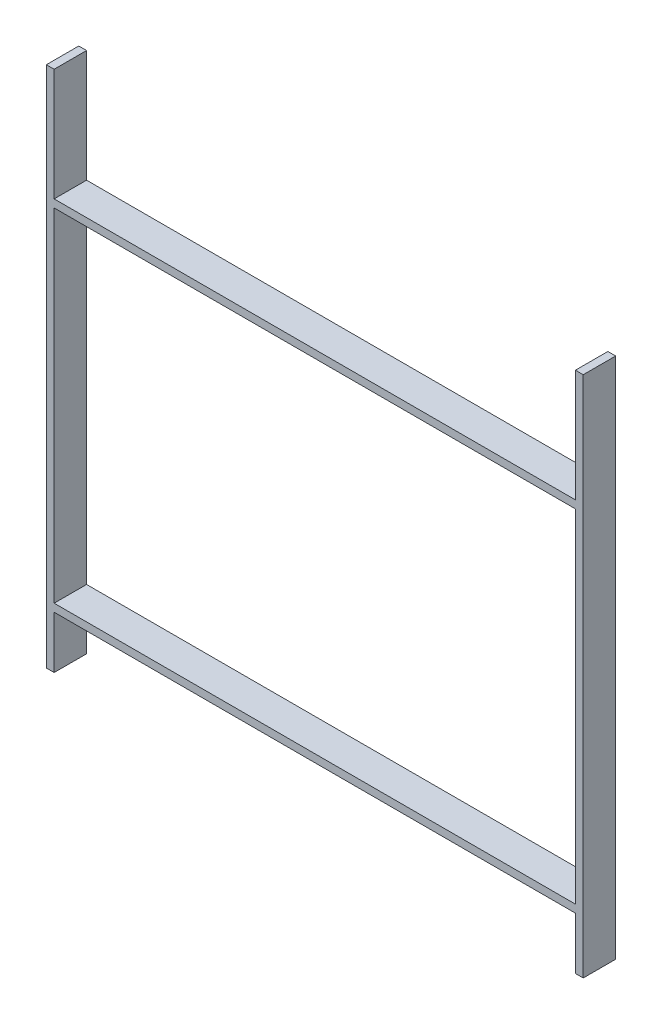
ISO-10303-21;
HEADER;
FILE_DESCRIPTION(('STEP AP214'),'2;1');
FILE_NAME('part.step','',(''),(''),'','','');
FILE_SCHEMA(('AUTOMOTIVE_DESIGN { 1 0 10303 214 1 1 1 1 }'));
ENDSEC;
DATA;
#1=APPLICATION_CONTEXT('core data for automotive mechanical design processes');
#2=APPLICATION_PROTOCOL_DEFINITION('international standard','automotive_design',2000,#1);
#3=PRODUCT_CONTEXT('',#1,'mechanical');
#4=PRODUCT('Part','Part','',(#3));
#5=PRODUCT_RELATED_PRODUCT_CATEGORY('part','',(#4));
#6=PRODUCT_DEFINITION_FORMATION('','',#4);
#7=PRODUCT_DEFINITION_CONTEXT('part definition',#1,'design');
#8=PRODUCT_DEFINITION('design','',#6,#7);
#9=PRODUCT_DEFINITION_SHAPE('','',#8);
#10=(LENGTH_UNIT() NAMED_UNIT(*) SI_UNIT(.MILLI.,.METRE.));
#11=(NAMED_UNIT(*) PLANE_ANGLE_UNIT() SI_UNIT($,.RADIAN.));
#12=(NAMED_UNIT(*) SI_UNIT($,.STERADIAN.) SOLID_ANGLE_UNIT());
#13=UNCERTAINTY_MEASURE_WITH_UNIT(LENGTH_MEASURE(1.E-05),#10,'distance_accuracy_value','');
#14=(GEOMETRIC_REPRESENTATION_CONTEXT(3) GLOBAL_UNCERTAINTY_ASSIGNED_CONTEXT((#13)) GLOBAL_UNIT_ASSIGNED_CONTEXT((#10,
#11,#12)) REPRESENTATION_CONTEXT('',''));
#15=CARTESIAN_POINT('',(0.,0.,0.));
#16=DIRECTION('',(0.,0.,1.));
#17=DIRECTION('',(1.,0.,0.));
#18=AXIS2_PLACEMENT_3D('',#15,#16,#17);
#19=CARTESIAN_POINT('',(-223.5,-149.,27.));
#20=DIRECTION('',(0.,0.,1.));
#21=DIRECTION('',(1.,0.,0.));
#22=AXIS2_PLACEMENT_3D('',#19,#20,#21);
#23=PLANE('',#22);
#24=DIRECTION('',(1.,0.,0.));
#25=VECTOR('',#24,1.);
#26=CARTESIAN_POINT('',(-217.,-142.5,27.));
#27=LINE('',#26,#25);
#28=CARTESIAN_POINT('',(-217.,-142.5,27.));
#29=VERTEX_POINT('',#28);
#30=CARTESIAN_POINT('',(217.,-142.5,27.));
#31=VERTEX_POINT('',#30);
#32=EDGE_CURVE('E230',#29,#31,#27,.T.);
#33=ORIENTED_EDGE('',*,*,#32,.F.);
#34=DIRECTION('',(0.,-1.,0.));
#35=VECTOR('',#34,1.);
#36=CARTESIAN_POINT('',(-217.,142.5,27.));
#37=LINE('',#36,#35);
#38=CARTESIAN_POINT('',(-217.,142.5,27.));
#39=VERTEX_POINT('',#38);
#40=EDGE_CURVE('E228',#39,#29,#37,.T.);
#41=ORIENTED_EDGE('',*,*,#40,.F.);
#42=DIRECTION('',(-1.,0.,0.));
#43=VECTOR('',#42,1.);
#44=CARTESIAN_POINT('',(-217.,142.5,27.));
#45=LINE('',#44,#43);
#46=CARTESIAN_POINT('',(217.,142.5,27.));
#47=VERTEX_POINT('',#46);
#48=EDGE_CURVE('E236',#47,#39,#45,.T.);
#49=ORIENTED_EDGE('',*,*,#48,.F.);
#50=DIRECTION('',(0.,1.,0.));
#51=VECTOR('',#50,1.);
#52=CARTESIAN_POINT('',(217.,142.5,27.));
#53=LINE('',#52,#51);
#54=EDGE_CURVE('E233',#31,#47,#53,.T.);
#55=ORIENTED_EDGE('',*,*,#54,.F.);
#56=EDGE_LOOP('',(#33,#41,#49,#55));
#57=FACE_BOUND('',#56,.T.);
#58=DIRECTION('',(0.,1.,0.));
#59=VECTOR('',#58,1.);
#60=CARTESIAN_POINT('',(-217.,-142.5,27.));
#61=LINE('',#60,#59);
#62=CARTESIAN_POINT('',(-217.,-192.5,27.));
#63=VERTEX_POINT('',#62);
#64=CARTESIAN_POINT('',(-217.,-149.,27.));
#65=VERTEX_POINT('',#64);
#66=EDGE_CURVE('E164',#63,#65,#61,.T.);
#67=ORIENTED_EDGE('',*,*,#66,.T.);
#68=DIRECTION('',(1.,0.,0.));
#69=VECTOR('',#68,1.);
#70=CARTESIAN_POINT('',(-223.5,-149.,27.));
#71=LINE('',#70,#69);
#72=CARTESIAN_POINT('',(217.,-149.,27.));
#73=VERTEX_POINT('',#72);
#74=EDGE_CURVE('E48',#65,#73,#71,.T.);
#75=ORIENTED_EDGE('',*,*,#74,.T.);
#76=DIRECTION('',(0.,-1.,0.));
#77=VECTOR('',#76,1.);
#78=CARTESIAN_POINT('',(217.,-142.5,27.));
#79=LINE('',#78,#77);
#80=CARTESIAN_POINT('',(217.,-192.5,27.));
#81=VERTEX_POINT('',#80);
#82=EDGE_CURVE('E173',#73,#81,#79,.T.);
#83=ORIENTED_EDGE('',*,*,#82,.T.);
#84=DIRECTION('',(1.,0.,0.));
#85=VECTOR('',#84,1.);
#86=CARTESIAN_POINT('',(217.,-192.5,27.));
#87=LINE('',#86,#85);
#88=CARTESIAN_POINT('',(223.5,-192.5,27.));
#89=VERTEX_POINT('',#88);
#90=EDGE_CURVE('E181',#81,#89,#87,.T.);
#91=ORIENTED_EDGE('',*,*,#90,.T.);
#92=DIRECTION('',(0.,1.,0.));
#93=VECTOR('',#92,1.);
#94=CARTESIAN_POINT('',(223.5,149.,27.));
#95=LINE('',#94,#93);
#96=CARTESIAN_POINT('',(223.5,242.5,27.));
#97=VERTEX_POINT('',#96);
#98=EDGE_CURVE('E40',#89,#97,#95,.T.);
#99=ORIENTED_EDGE('',*,*,#98,.T.);
#100=DIRECTION('',(-1.,0.,0.));
#101=VECTOR('',#100,1.);
#102=CARTESIAN_POINT('',(217.,242.5,27.));
#103=LINE('',#102,#101);
#104=CARTESIAN_POINT('',(217.,242.5,27.));
#105=VERTEX_POINT('',#104);
#106=EDGE_CURVE('E202',#97,#105,#103,.T.);
#107=ORIENTED_EDGE('',*,*,#106,.T.);
#108=DIRECTION('',(0.,-1.,0.));
#109=VECTOR('',#108,1.);
#110=CARTESIAN_POINT('',(217.,142.5,27.));
#111=LINE('',#110,#109);
#112=CARTESIAN_POINT('',(217.,149.,27.));
#113=VERTEX_POINT('',#112);
#114=EDGE_CURVE('E192',#105,#113,#111,.T.);
#115=ORIENTED_EDGE('',*,*,#114,.T.);
#116=DIRECTION('',(-1.,0.,0.));
#117=VECTOR('',#116,1.);
#118=CARTESIAN_POINT('',(-223.5,149.,27.));
#119=LINE('',#118,#117);
#120=CARTESIAN_POINT('',(-217.,149.,27.));
#121=VERTEX_POINT('',#120);
#122=EDGE_CURVE('E11',#113,#121,#119,.T.);
#123=ORIENTED_EDGE('',*,*,#122,.T.);
#124=DIRECTION('',(0.,1.,0.));
#125=VECTOR('',#124,1.);
#126=CARTESIAN_POINT('',(-217.,142.5,27.));
#127=LINE('',#126,#125);
#128=CARTESIAN_POINT('',(-217.,242.5,27.));
#129=VERTEX_POINT('',#128);
#130=EDGE_CURVE('E211',#121,#129,#127,.T.);
#131=ORIENTED_EDGE('',*,*,#130,.T.);
#132=DIRECTION('',(-1.,0.,0.));
#133=VECTOR('',#132,1.);
#134=CARTESIAN_POINT('',(-217.,242.5,27.));
#135=LINE('',#134,#133);
#136=CARTESIAN_POINT('',(-223.5,242.5,27.));
#137=VERTEX_POINT('',#136);
#138=EDGE_CURVE('E148',#129,#137,#135,.T.);
#139=ORIENTED_EDGE('',*,*,#138,.T.);
#140=DIRECTION('',(0.,-1.,0.));
#141=VECTOR('',#140,1.);
#142=CARTESIAN_POINT('',(-223.5,149.,27.));
#143=LINE('',#142,#141);
#144=CARTESIAN_POINT('',(-223.5,-192.5,27.));
#145=VERTEX_POINT('',#144);
#146=EDGE_CURVE('E143',#137,#145,#143,.T.);
#147=ORIENTED_EDGE('',*,*,#146,.T.);
#148=DIRECTION('',(1.,0.,0.));
#149=VECTOR('',#148,1.);
#150=CARTESIAN_POINT('',(-217.,-192.5,27.));
#151=LINE('',#150,#149);
#152=EDGE_CURVE('E146',#145,#63,#151,.T.);
#153=ORIENTED_EDGE('',*,*,#152,.T.);
#154=EDGE_LOOP('',(#67,#75,#83,#91,#99,#107,#115,#123,#131,#139,#147,#153));
#155=FACE_BOUND('',#154,.T.);
#156=ADVANCED_FACE('F31',(#57,#155),#23,.T.);
#157=CARTESIAN_POINT('',(-223.5,-149.,0.));
#158=DIRECTION('',(0.,0.,1.));
#159=DIRECTION('',(1.,0.,0.));
#160=AXIS2_PLACEMENT_3D('',#157,#158,#159);
#161=PLANE('',#160);
#162=DIRECTION('',(0.,-1.,0.));
#163=VECTOR('',#162,1.);
#164=CARTESIAN_POINT('',(-217.,142.5,0.));
#165=LINE('',#164,#163);
#166=CARTESIAN_POINT('',(-217.,142.5,0.));
#167=VERTEX_POINT('',#166);
#168=CARTESIAN_POINT('',(-217.,-142.5,0.));
#169=VERTEX_POINT('',#168);
#170=EDGE_CURVE('E227',#167,#169,#165,.T.);
#171=ORIENTED_EDGE('',*,*,#170,.T.);
#172=DIRECTION('',(1.,0.,0.));
#173=VECTOR('',#172,1.);
#174=CARTESIAN_POINT('',(-217.,-142.5,0.));
#175=LINE('',#174,#173);
#176=CARTESIAN_POINT('',(217.,-142.5,0.));
#177=VERTEX_POINT('',#176);
#178=EDGE_CURVE('E241',#169,#177,#175,.T.);
#179=ORIENTED_EDGE('',*,*,#178,.T.);
#180=DIRECTION('',(0.,1.,0.));
#181=VECTOR('',#180,1.);
#182=CARTESIAN_POINT('',(217.,142.5,0.));
#183=LINE('',#182,#181);
#184=CARTESIAN_POINT('',(217.,142.5,0.));
#185=VERTEX_POINT('',#184);
#186=EDGE_CURVE('E244',#177,#185,#183,.T.);
#187=ORIENTED_EDGE('',*,*,#186,.T.);
#188=DIRECTION('',(-1.,0.,0.));
#189=VECTOR('',#188,1.);
#190=CARTESIAN_POINT('',(-217.,142.5,0.));
#191=LINE('',#190,#189);
#192=EDGE_CURVE('E231',#185,#167,#191,.T.);
#193=ORIENTED_EDGE('',*,*,#192,.T.);
#194=EDGE_LOOP('',(#171,#179,#187,#193));
#195=FACE_BOUND('',#194,.T.);
#196=DIRECTION('',(1.,0.,0.));
#197=VECTOR('',#196,1.);
#198=CARTESIAN_POINT('',(-223.5,-149.,0.));
#199=LINE('',#198,#197);
#200=CARTESIAN_POINT('',(-217.,-149.,0.));
#201=VERTEX_POINT('',#200);
#202=CARTESIAN_POINT('',(217.,-149.,0.));
#203=VERTEX_POINT('',#202);
#204=EDGE_CURVE('E261',#201,#203,#199,.T.);
#205=ORIENTED_EDGE('',*,*,#204,.F.);
#206=DIRECTION('',(0.,-1.,0.));
#207=VECTOR('',#206,1.);
#208=CARTESIAN_POINT('',(-217.,-142.5,0.));
#209=LINE('',#208,#207);
#210=CARTESIAN_POINT('',(-217.,-192.5,0.));
#211=VERTEX_POINT('',#210);
#212=EDGE_CURVE('E174',#201,#211,#209,.T.);
#213=ORIENTED_EDGE('',*,*,#212,.T.);
#214=DIRECTION('',(-1.,0.,0.));
#215=VECTOR('',#214,1.);
#216=CARTESIAN_POINT('',(-217.,-192.5,0.));
#217=LINE('',#216,#215);
#218=CARTESIAN_POINT('',(-223.5,-192.5,0.));
#219=VERTEX_POINT('',#218);
#220=EDGE_CURVE('E169',#211,#219,#217,.T.);
#221=ORIENTED_EDGE('',*,*,#220,.T.);
#222=DIRECTION('',(0.,-1.,0.));
#223=VECTOR('',#222,1.);
#224=CARTESIAN_POINT('',(-223.5,149.,0.));
#225=LINE('',#224,#223);
#226=CARTESIAN_POINT('',(-223.5,242.5,0.));
#227=VERTEX_POINT('',#226);
#228=EDGE_CURVE('E155',#227,#219,#225,.T.);
#229=ORIENTED_EDGE('',*,*,#228,.F.);
#230=DIRECTION('',(1.,0.,0.));
#231=VECTOR('',#230,1.);
#232=CARTESIAN_POINT('',(-217.,242.5,0.));
#233=LINE('',#232,#231);
#234=CARTESIAN_POINT('',(-217.,242.5,0.));
#235=VERTEX_POINT('',#234);
#236=EDGE_CURVE('E215',#227,#235,#233,.T.);
#237=ORIENTED_EDGE('',*,*,#236,.T.);
#238=DIRECTION('',(0.,-1.,0.));
#239=VECTOR('',#238,1.);
#240=CARTESIAN_POINT('',(-217.,142.5,0.));
#241=LINE('',#240,#239);
#242=CARTESIAN_POINT('',(-217.,149.,0.));
#243=VERTEX_POINT('',#242);
#244=EDGE_CURVE('E212',#235,#243,#241,.T.);
#245=ORIENTED_EDGE('',*,*,#244,.T.);
#246=DIRECTION('',(-1.,0.,0.));
#247=VECTOR('',#246,1.);
#248=CARTESIAN_POINT('',(-223.5,149.,0.));
#249=LINE('',#248,#247);
#250=CARTESIAN_POINT('',(217.,149.,0.));
#251=VERTEX_POINT('',#250);
#252=EDGE_CURVE('E35',#251,#243,#249,.T.);
#253=ORIENTED_EDGE('',*,*,#252,.F.);
#254=DIRECTION('',(0.,1.,0.));
#255=VECTOR('',#254,1.);
#256=CARTESIAN_POINT('',(217.,142.5,0.));
#257=LINE('',#256,#255);
#258=CARTESIAN_POINT('',(217.,242.5,0.));
#259=VERTEX_POINT('',#258);
#260=EDGE_CURVE('E196',#251,#259,#257,.T.);
#261=ORIENTED_EDGE('',*,*,#260,.T.);
#262=DIRECTION('',(1.,0.,0.));
#263=VECTOR('',#262,1.);
#264=CARTESIAN_POINT('',(217.,242.5,0.));
#265=LINE('',#264,#263);
#266=CARTESIAN_POINT('',(223.5,242.5,0.));
#267=VERTEX_POINT('',#266);
#268=EDGE_CURVE('E193',#259,#267,#265,.T.);
#269=ORIENTED_EDGE('',*,*,#268,.T.);
#270=DIRECTION('',(0.,1.,0.));
#271=VECTOR('',#270,1.);
#272=CARTESIAN_POINT('',(223.5,149.,0.));
#273=LINE('',#272,#271);
#274=CARTESIAN_POINT('',(223.5,-192.5,0.));
#275=VERTEX_POINT('',#274);
#276=EDGE_CURVE('E262',#275,#267,#273,.T.);
#277=ORIENTED_EDGE('',*,*,#276,.F.);
#278=DIRECTION('',(-1.,0.,0.));
#279=VECTOR('',#278,1.);
#280=CARTESIAN_POINT('',(217.,-192.5,0.));
#281=LINE('',#280,#279);
#282=CARTESIAN_POINT('',(217.,-192.5,0.));
#283=VERTEX_POINT('',#282);
#284=EDGE_CURVE('E178',#275,#283,#281,.T.);
#285=ORIENTED_EDGE('',*,*,#284,.T.);
#286=DIRECTION('',(0.,1.,0.));
#287=VECTOR('',#286,1.);
#288=CARTESIAN_POINT('',(217.,-142.5,0.));
#289=LINE('',#288,#287);
#290=EDGE_CURVE('E175',#283,#203,#289,.T.);
#291=ORIENTED_EDGE('',*,*,#290,.T.);
#292=EDGE_LOOP('',(#205,#213,#221,#229,#237,#245,#253,#261,#269,#277,#285,#291));
#293=FACE_BOUND('',#292,.T.);
#294=ADVANCED_FACE('F276',(#195,#293),#161,.F.);
#295=CARTESIAN_POINT('',(-223.5,149.,27.));
#296=DIRECTION('',(1.,0.,0.));
#297=DIRECTION('',(0.,1.,0.));
#298=AXIS2_PLACEMENT_3D('',#295,#296,#297);
#299=PLANE('',#298);
#300=ORIENTED_EDGE('',*,*,#228,.T.);
#301=DIRECTION('',(0.,0.,1.));
#302=VECTOR('',#301,1.);
#303=CARTESIAN_POINT('',(-223.5,-192.5,-100.211027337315));
#304=LINE('',#303,#302);
#305=EDGE_CURVE('E154',#219,#145,#304,.T.);
#306=ORIENTED_EDGE('',*,*,#305,.T.);
#307=ORIENTED_EDGE('',*,*,#146,.F.);
#308=DIRECTION('',(0.,0.,1.));
#309=VECTOR('',#308,1.);
#310=CARTESIAN_POINT('',(-223.5,242.5,-100.211027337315));
#311=LINE('',#310,#309);
#312=EDGE_CURVE('E216',#227,#137,#311,.T.);
#313=ORIENTED_EDGE('',*,*,#312,.F.);
#314=EDGE_LOOP('',(#300,#306,#307,#313));
#315=FACE_BOUND('',#314,.T.);
#316=ADVANCED_FACE('F33',(#315),#299,.F.);
#317=CARTESIAN_POINT('',(-223.5,-149.,27.));
#318=DIRECTION('',(0.,1.,0.));
#319=DIRECTION('',(0.,0.,1.));
#320=AXIS2_PLACEMENT_3D('',#317,#318,#319);
#321=PLANE('',#320);
#322=ORIENTED_EDGE('',*,*,#74,.F.);
#323=DIRECTION('',(0.,0.,-1.));
#324=VECTOR('',#323,1.);
#325=CARTESIAN_POINT('',(-217.,-149.,27.));
#326=LINE('',#325,#324);
#327=EDGE_CURVE('E171',#65,#201,#326,.T.);
#328=ORIENTED_EDGE('',*,*,#327,.T.);
#329=ORIENTED_EDGE('',*,*,#204,.T.);
#330=DIRECTION('',(0.,0.,1.));
#331=VECTOR('',#330,1.);
#332=CARTESIAN_POINT('',(217.,-149.,27.));
#333=LINE('',#332,#331);
#334=EDGE_CURVE('E190',#203,#73,#333,.T.);
#335=ORIENTED_EDGE('',*,*,#334,.T.);
#336=EDGE_LOOP('',(#322,#328,#329,#335));
#337=FACE_BOUND('',#336,.T.);
#338=ADVANCED_FACE('F310',(#337),#321,.F.);
#339=CARTESIAN_POINT('',(223.5,149.,27.));
#340=DIRECTION('',(-1.,0.,0.));
#341=DIRECTION('',(0.,-1.,0.));
#342=AXIS2_PLACEMENT_3D('',#339,#340,#341);
#343=PLANE('',#342);
#344=DIRECTION('',(0.,0.,1.));
#345=VECTOR('',#344,1.);
#346=CARTESIAN_POINT('',(223.5,242.5,-100.211027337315));
#347=LINE('',#346,#345);
#348=EDGE_CURVE('E205',#267,#97,#347,.T.);
#349=ORIENTED_EDGE('',*,*,#348,.T.);
#350=ORIENTED_EDGE('',*,*,#98,.F.);
#351=DIRECTION('',(0.,0.,1.));
#352=VECTOR('',#351,1.);
#353=CARTESIAN_POINT('',(223.5,-192.5,-100.211027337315));
#354=LINE('',#353,#352);
#355=EDGE_CURVE('E179',#275,#89,#354,.T.);
#356=ORIENTED_EDGE('',*,*,#355,.F.);
#357=ORIENTED_EDGE('',*,*,#276,.T.);
#358=EDGE_LOOP('',(#349,#350,#356,#357));
#359=FACE_BOUND('',#358,.T.);
#360=ADVANCED_FACE('F308',(#359),#343,.F.);
#361=CARTESIAN_POINT('',(-223.5,149.,27.));
#362=DIRECTION('',(0.,-1.,0.));
#363=DIRECTION('',(0.,0.,-1.));
#364=AXIS2_PLACEMENT_3D('',#361,#362,#363);
#365=PLANE('',#364);
#366=ORIENTED_EDGE('',*,*,#122,.F.);
#367=DIRECTION('',(0.,0.,-1.));
#368=VECTOR('',#367,1.);
#369=CARTESIAN_POINT('',(217.,149.,27.));
#370=LINE('',#369,#368);
#371=EDGE_CURVE('E199',#113,#251,#370,.T.);
#372=ORIENTED_EDGE('',*,*,#371,.T.);
#373=ORIENTED_EDGE('',*,*,#252,.T.);
#374=DIRECTION('',(0.,0.,1.));
#375=VECTOR('',#374,1.);
#376=CARTESIAN_POINT('',(-217.,149.,27.));
#377=LINE('',#376,#375);
#378=EDGE_CURVE('E224',#243,#121,#377,.T.);
#379=ORIENTED_EDGE('',*,*,#378,.T.);
#380=EDGE_LOOP('',(#366,#372,#373,#379));
#381=FACE_BOUND('',#380,.T.);
#382=ADVANCED_FACE('F267',(#381),#365,.F.);
#383=CARTESIAN_POINT('',(-217.,142.5,27.));
#384=DIRECTION('',(1.,0.,0.));
#385=DIRECTION('',(0.,1.,0.));
#386=AXIS2_PLACEMENT_3D('',#383,#384,#385);
#387=PLANE('',#386);
#388=ORIENTED_EDGE('',*,*,#170,.F.);
#389=DIRECTION('',(0.,0.,-1.));
#390=VECTOR('',#389,1.);
#391=CARTESIAN_POINT('',(-217.,142.5,27.));
#392=LINE('',#391,#390);
#393=EDGE_CURVE('E238',#39,#167,#392,.T.);
#394=ORIENTED_EDGE('',*,*,#393,.F.);
#395=ORIENTED_EDGE('',*,*,#40,.T.);
#396=DIRECTION('',(0.,0.,-1.));
#397=VECTOR('',#396,1.);
#398=CARTESIAN_POINT('',(-217.,-142.5,27.));
#399=LINE('',#398,#397);
#400=EDGE_CURVE('E255',#29,#169,#399,.T.);
#401=ORIENTED_EDGE('',*,*,#400,.T.);
#402=EDGE_LOOP('',(#388,#394,#395,#401));
#403=FACE_BOUND('',#402,.T.);
#404=ADVANCED_FACE('F303',(#403),#387,.T.);
#405=CARTESIAN_POINT('',(-217.,-142.5,27.));
#406=DIRECTION('',(0.,1.,0.));
#407=DIRECTION('',(0.,0.,1.));
#408=AXIS2_PLACEMENT_3D('',#405,#406,#407);
#409=PLANE('',#408);
#410=ORIENTED_EDGE('',*,*,#178,.F.);
#411=ORIENTED_EDGE('',*,*,#400,.F.);
#412=ORIENTED_EDGE('',*,*,#32,.T.);
#413=DIRECTION('',(0.,0.,-1.));
#414=VECTOR('',#413,1.);
#415=CARTESIAN_POINT('',(217.,-142.5,27.));
#416=LINE('',#415,#414);
#417=EDGE_CURVE('E253',#31,#177,#416,.T.);
#418=ORIENTED_EDGE('',*,*,#417,.T.);
#419=EDGE_LOOP('',(#410,#411,#412,#418));
#420=FACE_BOUND('',#419,.T.);
#421=ADVANCED_FACE('F415',(#420),#409,.T.);
#422=CARTESIAN_POINT('',(217.,142.5,27.));
#423=DIRECTION('',(-1.,0.,0.));
#424=DIRECTION('',(0.,-1.,0.));
#425=AXIS2_PLACEMENT_3D('',#422,#423,#424);
#426=PLANE('',#425);
#427=ORIENTED_EDGE('',*,*,#186,.F.);
#428=ORIENTED_EDGE('',*,*,#417,.F.);
#429=ORIENTED_EDGE('',*,*,#54,.T.);
#430=DIRECTION('',(0.,0.,-1.));
#431=VECTOR('',#430,1.);
#432=CARTESIAN_POINT('',(217.,142.5,27.));
#433=LINE('',#432,#431);
#434=EDGE_CURVE('E251',#47,#185,#433,.T.);
#435=ORIENTED_EDGE('',*,*,#434,.T.);
#436=EDGE_LOOP('',(#427,#428,#429,#435));
#437=FACE_BOUND('',#436,.T.);
#438=ADVANCED_FACE('F421',(#437),#426,.T.);
#439=CARTESIAN_POINT('',(-217.,142.5,27.));
#440=DIRECTION('',(0.,-1.,0.));
#441=DIRECTION('',(0.,0.,-1.));
#442=AXIS2_PLACEMENT_3D('',#439,#440,#441);
#443=PLANE('',#442);
#444=ORIENTED_EDGE('',*,*,#192,.F.);
#445=ORIENTED_EDGE('',*,*,#434,.F.);
#446=ORIENTED_EDGE('',*,*,#48,.T.);
#447=ORIENTED_EDGE('',*,*,#393,.T.);
#448=EDGE_LOOP('',(#444,#445,#446,#447));
#449=FACE_BOUND('',#448,.T.);
#450=ADVANCED_FACE('F290',(#449),#443,.T.);
#451=CARTESIAN_POINT('',(-217.,142.5,-100.211027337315));
#452=DIRECTION('',(1.,0.,0.));
#453=DIRECTION('',(0.,0.,-1.));
#454=AXIS2_PLACEMENT_3D('',#451,#452,#453);
#455=PLANE('',#454);
#456=ORIENTED_EDGE('',*,*,#378,.F.);
#457=ORIENTED_EDGE('',*,*,#244,.F.);
#458=DIRECTION('',(0.,0.,1.));
#459=VECTOR('',#458,1.);
#460=CARTESIAN_POINT('',(-217.,242.5,-100.211027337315));
#461=LINE('',#460,#459);
#462=EDGE_CURVE('E219',#235,#129,#461,.T.);
#463=ORIENTED_EDGE('',*,*,#462,.T.);
#464=ORIENTED_EDGE('',*,*,#130,.F.);
#465=EDGE_LOOP('',(#456,#457,#463,#464));
#466=FACE_BOUND('',#465,.T.);
#467=ADVANCED_FACE('F274',(#466),#455,.T.);
#468=CARTESIAN_POINT('',(-217.,242.5,-100.211027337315));
#469=DIRECTION('',(0.,1.,0.));
#470=DIRECTION('',(0.,0.,1.));
#471=AXIS2_PLACEMENT_3D('',#468,#469,#470);
#472=PLANE('',#471);
#473=ORIENTED_EDGE('',*,*,#236,.F.);
#474=ORIENTED_EDGE('',*,*,#312,.T.);
#475=ORIENTED_EDGE('',*,*,#138,.F.);
#476=ORIENTED_EDGE('',*,*,#462,.F.);
#477=EDGE_LOOP('',(#473,#474,#475,#476));
#478=FACE_BOUND('',#477,.T.);
#479=ADVANCED_FACE('F279',(#478),#472,.T.);
#480=CARTESIAN_POINT('',(217.,142.5,-100.211027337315));
#481=DIRECTION('',(-1.,0.,0.));
#482=DIRECTION('',(0.,0.,1.));
#483=AXIS2_PLACEMENT_3D('',#480,#481,#482);
#484=PLANE('',#483);
#485=ORIENTED_EDGE('',*,*,#371,.F.);
#486=ORIENTED_EDGE('',*,*,#114,.F.);
#487=DIRECTION('',(0.,0.,1.));
#488=VECTOR('',#487,1.);
#489=CARTESIAN_POINT('',(217.,242.5,-100.211027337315));
#490=LINE('',#489,#488);
#491=EDGE_CURVE('E197',#259,#105,#490,.T.);
#492=ORIENTED_EDGE('',*,*,#491,.F.);
#493=ORIENTED_EDGE('',*,*,#260,.F.);
#494=EDGE_LOOP('',(#485,#486,#492,#493));
#495=FACE_BOUND('',#494,.T.);
#496=ADVANCED_FACE('F281',(#495),#484,.T.);
#497=CARTESIAN_POINT('',(217.,242.5,-100.211027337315));
#498=DIRECTION('',(0.,1.,0.));
#499=DIRECTION('',(0.,0.,1.));
#500=AXIS2_PLACEMENT_3D('',#497,#498,#499);
#501=PLANE('',#500);
#502=ORIENTED_EDGE('',*,*,#268,.F.);
#503=ORIENTED_EDGE('',*,*,#491,.T.);
#504=ORIENTED_EDGE('',*,*,#106,.F.);
#505=ORIENTED_EDGE('',*,*,#348,.F.);
#506=EDGE_LOOP('',(#502,#503,#504,#505));
#507=FACE_BOUND('',#506,.T.);
#508=ADVANCED_FACE('F287',(#507),#501,.T.);
#509=CARTESIAN_POINT('',(217.,-142.5,-100.211027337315));
#510=DIRECTION('',(-1.,0.,0.));
#511=DIRECTION('',(0.,0.,1.));
#512=AXIS2_PLACEMENT_3D('',#509,#510,#511);
#513=PLANE('',#512);
#514=ORIENTED_EDGE('',*,*,#334,.F.);
#515=ORIENTED_EDGE('',*,*,#290,.F.);
#516=DIRECTION('',(0.,0.,1.));
#517=VECTOR('',#516,1.);
#518=CARTESIAN_POINT('',(217.,-192.5,-100.211027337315));
#519=LINE('',#518,#517);
#520=EDGE_CURVE('E184',#283,#81,#519,.T.);
#521=ORIENTED_EDGE('',*,*,#520,.T.);
#522=ORIENTED_EDGE('',*,*,#82,.F.);
#523=EDGE_LOOP('',(#514,#515,#521,#522));
#524=FACE_BOUND('',#523,.T.);
#525=ADVANCED_FACE('F348',(#524),#513,.T.);
#526=CARTESIAN_POINT('',(217.,-192.5,-100.211027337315));
#527=DIRECTION('',(0.,-1.,0.));
#528=DIRECTION('',(0.,0.,-1.));
#529=AXIS2_PLACEMENT_3D('',#526,#527,#528);
#530=PLANE('',#529);
#531=ORIENTED_EDGE('',*,*,#284,.F.);
#532=ORIENTED_EDGE('',*,*,#355,.T.);
#533=ORIENTED_EDGE('',*,*,#90,.F.);
#534=ORIENTED_EDGE('',*,*,#520,.F.);
#535=EDGE_LOOP('',(#531,#532,#533,#534));
#536=FACE_BOUND('',#535,.T.);
#537=ADVANCED_FACE('F358',(#536),#530,.T.);
#538=CARTESIAN_POINT('',(-217.,-142.5,-100.211027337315));
#539=DIRECTION('',(1.,0.,0.));
#540=DIRECTION('',(0.,0.,-1.));
#541=AXIS2_PLACEMENT_3D('',#538,#539,#540);
#542=PLANE('',#541);
#543=ORIENTED_EDGE('',*,*,#327,.F.);
#544=ORIENTED_EDGE('',*,*,#66,.F.);
#545=DIRECTION('',(0.,0.,1.));
#546=VECTOR('',#545,1.);
#547=CARTESIAN_POINT('',(-217.,-192.5,-100.211027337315));
#548=LINE('',#547,#546);
#549=EDGE_CURVE('E159',#211,#63,#548,.T.);
#550=ORIENTED_EDGE('',*,*,#549,.F.);
#551=ORIENTED_EDGE('',*,*,#212,.F.);
#552=EDGE_LOOP('',(#543,#544,#550,#551));
#553=FACE_BOUND('',#552,.T.);
#554=ADVANCED_FACE('F368',(#553),#542,.T.);
#555=CARTESIAN_POINT('',(-217.,-192.5,-100.211027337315));
#556=DIRECTION('',(0.,-1.,0.));
#557=DIRECTION('',(0.,0.,-1.));
#558=AXIS2_PLACEMENT_3D('',#555,#556,#557);
#559=PLANE('',#558);
#560=ORIENTED_EDGE('',*,*,#220,.F.);
#561=ORIENTED_EDGE('',*,*,#549,.T.);
#562=ORIENTED_EDGE('',*,*,#152,.F.);
#563=ORIENTED_EDGE('',*,*,#305,.F.);
#564=EDGE_LOOP('',(#560,#561,#562,#563));
#565=FACE_BOUND('',#564,.T.);
#566=ADVANCED_FACE('F161',(#565),#559,.T.);
#567=CLOSED_SHELL('',(#156,#294,#316,#338,#360,#382,#404,#421,#438,#450,#467,#479,#496,#508,
#525,#537,#554,#566));
#568=MANIFOLD_SOLID_BREP('B2',#567);
#569=ADVANCED_BREP_SHAPE_REPRESENTATION('',(#18,#568),#14);
#570=SHAPE_DEFINITION_REPRESENTATION(#9,#569);
ENDSEC;
END-ISO-10303-21;
